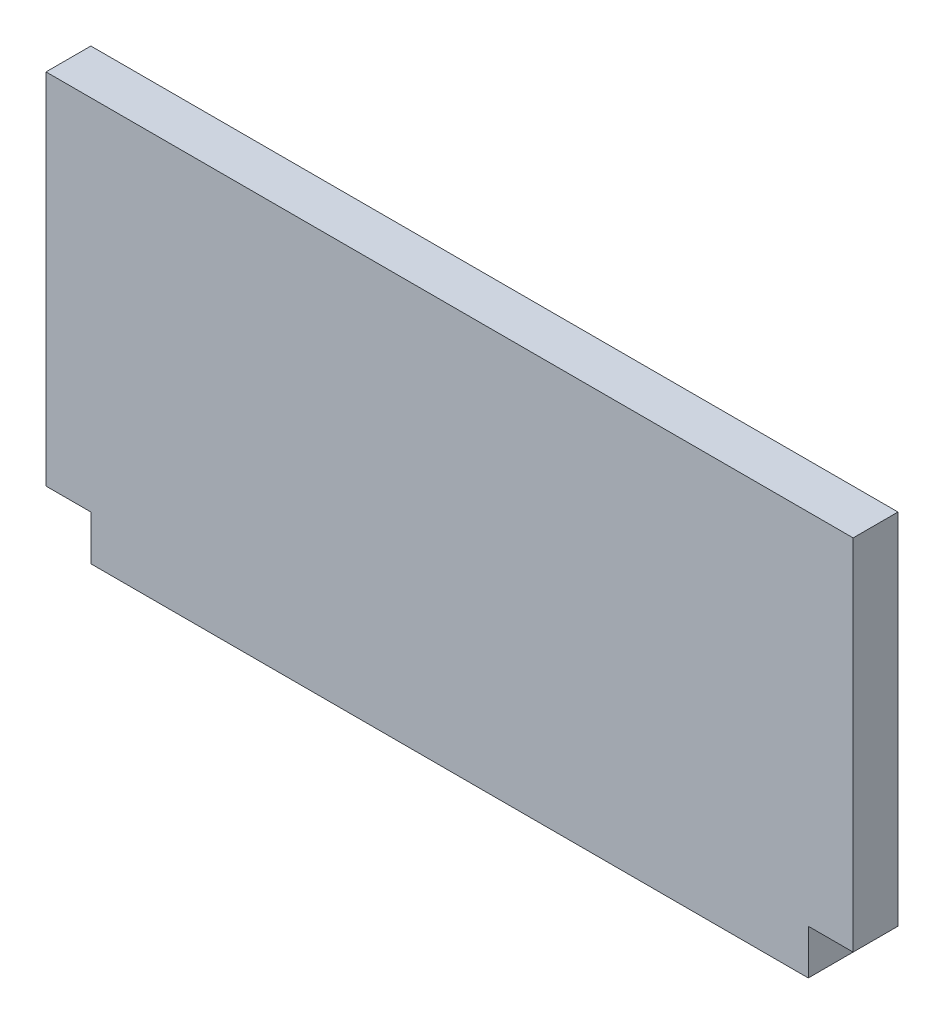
from build123d import *

# Parameters (mm, degrees)
BOSS_EXTRUDE1_DEPTH = 6.35


with BuildPart() as part:
    # Sketch1 → Boss-Extrude1 (new body)
    with BuildSketch(Plane.XY):
        Polygon((-57.15, -25.4), (-57.15, 25.4), (57.15, 25.4), (57.15, -25.4), (50.8, -25.4), (50.8, -31.75), (-50.8, -31.75), (-50.8, -25.4), align=None)
    extrude(amount=BOSS_EXTRUDE1_DEPTH)


solid = part.part
